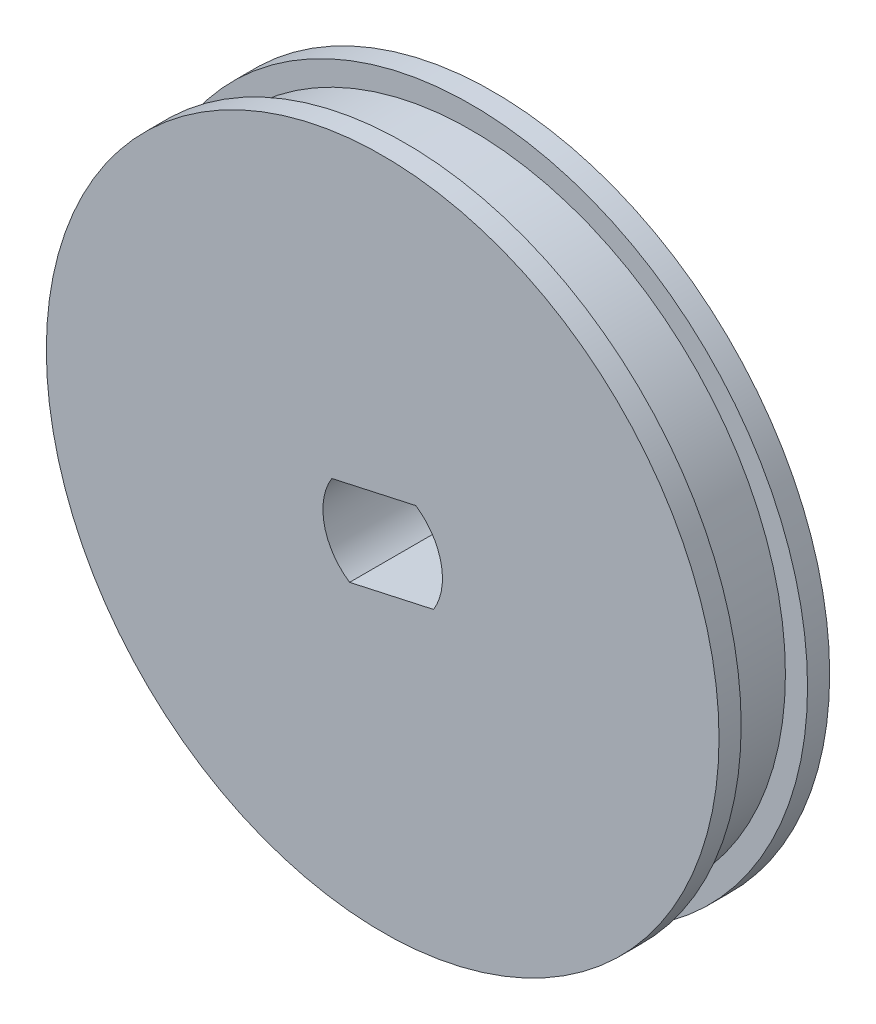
ISO-10303-21;
HEADER;
FILE_DESCRIPTION(('STEP AP214'),'2;1');
FILE_NAME('part.step','',(''),(''),'','','');
FILE_SCHEMA(('AUTOMOTIVE_DESIGN { 1 0 10303 214 1 1 1 1 }'));
ENDSEC;
DATA;
#1=APPLICATION_CONTEXT('core data for automotive mechanical design processes');
#2=APPLICATION_PROTOCOL_DEFINITION('international standard','automotive_design',2000,#1);
#3=PRODUCT_CONTEXT('',#1,'mechanical');
#4=PRODUCT('Part','Part','',(#3));
#5=PRODUCT_RELATED_PRODUCT_CATEGORY('part','',(#4));
#6=PRODUCT_DEFINITION_FORMATION('','',#4);
#7=PRODUCT_DEFINITION_CONTEXT('part definition',#1,'design');
#8=PRODUCT_DEFINITION('design','',#6,#7);
#9=PRODUCT_DEFINITION_SHAPE('','',#8);
#10=(LENGTH_UNIT() NAMED_UNIT(*) SI_UNIT(.MILLI.,.METRE.));
#11=(NAMED_UNIT(*) PLANE_ANGLE_UNIT() SI_UNIT($,.RADIAN.));
#12=(NAMED_UNIT(*) SI_UNIT($,.STERADIAN.) SOLID_ANGLE_UNIT());
#13=UNCERTAINTY_MEASURE_WITH_UNIT(LENGTH_MEASURE(1.E-05),#10,'distance_accuracy_value','');
#14=(GEOMETRIC_REPRESENTATION_CONTEXT(3) GLOBAL_UNCERTAINTY_ASSIGNED_CONTEXT((#13)) GLOBAL_UNIT_ASSIGNED_CONTEXT((#10,
#11,#12)) REPRESENTATION_CONTEXT('',''));
#15=CARTESIAN_POINT('',(0.,0.,0.));
#16=DIRECTION('',(0.,0.,1.));
#17=DIRECTION('',(1.,0.,0.));
#18=AXIS2_PLACEMENT_3D('',#15,#16,#17);
#19=CARTESIAN_POINT('',(22.4165324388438,-13.7076740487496,-1.5));
#20=DIRECTION('',(0.,0.,1.));
#21=DIRECTION('',(-1.,0.,0.));
#22=AXIS2_PLACEMENT_3D('',#19,#20,#21);
#23=CYLINDRICAL_SURFACE('',#22,14.2);
#24=CARTESIAN_POINT('',(22.4165324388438,-13.7076740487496,-1.5));
#25=DIRECTION('',(0.,0.,1.));
#26=DIRECTION('',(1.,0.,0.));
#27=AXIS2_PLACEMENT_3D('',#24,#25,#26);
#28=CIRCLE('',#27,14.2);
#29=CARTESIAN_POINT('',(36.6165324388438,-13.7076740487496,-1.5));
#30=VERTEX_POINT('',#29);
#31=EDGE_CURVE('E11',#30,#30,#28,.T.);
#32=ORIENTED_EDGE('',*,*,#31,.T.);
#33=EDGE_LOOP('',(#32));
#34=FACE_BOUND('',#33,.T.);
#35=CARTESIAN_POINT('',(22.4165324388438,-13.7076740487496,1.5));
#36=DIRECTION('',(0.,0.,1.));
#37=DIRECTION('',(1.,0.,0.));
#38=AXIS2_PLACEMENT_3D('',#35,#36,#37);
#39=CIRCLE('',#38,14.2);
#40=CARTESIAN_POINT('',(36.6165324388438,-13.7076740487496,1.5));
#41=VERTEX_POINT('',#40);
#42=EDGE_CURVE('E44',#41,#41,#39,.T.);
#43=ORIENTED_EDGE('',*,*,#42,.F.);
#44=EDGE_LOOP('',(#43));
#45=FACE_BOUND('',#44,.T.);
#46=ADVANCED_FACE('F41',(#34,#45),#23,.T.);
#47=CARTESIAN_POINT('',(22.4165324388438,-13.7076740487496,-2.5));
#48=DIRECTION('',(0.,0.,1.));
#49=DIRECTION('',(-1.,0.,0.));
#50=AXIS2_PLACEMENT_3D('',#47,#48,#49);
#51=CYLINDRICAL_SURFACE('',#50,15.2);
#52=CARTESIAN_POINT('',(22.4165324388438,-13.7076740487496,-2.5));
#53=DIRECTION('',(0.,0.,1.));
#54=DIRECTION('',(1.,0.,0.));
#55=AXIS2_PLACEMENT_3D('',#52,#53,#54);
#56=CIRCLE('',#55,15.2);
#57=CARTESIAN_POINT('',(37.6165324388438,-13.7076740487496,-2.5));
#58=VERTEX_POINT('',#57);
#59=EDGE_CURVE('E49',#58,#58,#56,.T.);
#60=ORIENTED_EDGE('',*,*,#59,.T.);
#61=EDGE_LOOP('',(#60));
#62=FACE_BOUND('',#61,.T.);
#63=CARTESIAN_POINT('',(22.4165324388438,-13.7076740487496,-1.5));
#64=DIRECTION('',(0.,0.,1.));
#65=DIRECTION('',(1.,0.,0.));
#66=AXIS2_PLACEMENT_3D('',#63,#64,#65);
#67=CIRCLE('',#66,15.2);
#68=CARTESIAN_POINT('',(37.6165324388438,-13.7076740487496,-1.5));
#69=VERTEX_POINT('',#68);
#70=EDGE_CURVE('E127',#69,#69,#67,.T.);
#71=ORIENTED_EDGE('',*,*,#70,.F.);
#72=EDGE_LOOP('',(#71));
#73=FACE_BOUND('',#72,.T.);
#74=ADVANCED_FACE('F138',(#62,#73),#51,.T.);
#75=CARTESIAN_POINT('',(22.4165324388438,-13.7076740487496,-2.5));
#76=DIRECTION('',(0.,0.,-1.));
#77=DIRECTION('',(1.,0.,0.));
#78=AXIS2_PLACEMENT_3D('',#75,#76,#77);
#79=PLANE('',#78);
#80=CARTESIAN_POINT('',(22.4165324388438,-13.7076740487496,-2.5));
#81=DIRECTION('',(0.,0.,1.));
#82=DIRECTION('',(1.,0.,0.));
#83=AXIS2_PLACEMENT_3D('',#80,#81,#82);
#84=CIRCLE('',#83,2.7);
#85=CARTESIAN_POINT('',(24.7170575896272,-15.1210331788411,-2.5));
#86=VERTEX_POINT('',#85);
#87=CARTESIAN_POINT('',(23.9106554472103,-11.4587639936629,-2.5));
#88=VERTEX_POINT('',#87);
#89=EDGE_CURVE('E110',#86,#88,#84,.T.);
#90=ORIENTED_EDGE('',*,*,#89,.T.);
#91=DIRECTION('',(-0.97660511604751,-0.215040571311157,0.));
#92=VECTOR('',#91,1.);
#93=CARTESIAN_POINT('',(23.9106554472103,-11.4587639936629,-2.5));
#94=LINE('',#93,#92);
#95=CARTESIAN_POINT('',(20.1160072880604,-12.294314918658,-2.5));
#96=VERTEX_POINT('',#95);
#97=EDGE_CURVE('E87',#88,#96,#94,.T.);
#98=ORIENTED_EDGE('',*,*,#97,.T.);
#99=CARTESIAN_POINT('',(22.4165324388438,-13.7076740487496,-2.5));
#100=DIRECTION('',(0.,0.,1.));
#101=DIRECTION('',(1.,0.,0.));
#102=AXIS2_PLACEMENT_3D('',#99,#100,#101);
#103=CIRCLE('',#102,2.70000000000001);
#104=CARTESIAN_POINT('',(20.9224094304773,-15.9565841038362,-2.5));
#105=VERTEX_POINT('',#104);
#106=EDGE_CURVE('E105',#96,#105,#103,.T.);
#107=ORIENTED_EDGE('',*,*,#106,.T.);
#108=DIRECTION('',(0.97660511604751,0.215040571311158,0.));
#109=VECTOR('',#108,1.);
#110=CARTESIAN_POINT('',(20.9224094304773,-15.9565841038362,-2.5));
#111=LINE('',#110,#109);
#112=EDGE_CURVE('E102',#105,#86,#111,.T.);
#113=ORIENTED_EDGE('',*,*,#112,.T.);
#114=EDGE_LOOP('',(#90,#98,#107,#113));
#115=FACE_BOUND('',#114,.T.);
#116=ORIENTED_EDGE('',*,*,#59,.F.);
#117=EDGE_LOOP('',(#116));
#118=FACE_BOUND('',#117,.T.);
#119=ADVANCED_FACE('F143',(#115,#118),#79,.T.);
#120=CARTESIAN_POINT('',(22.4165324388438,-13.7076740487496,-1.5));
#121=DIRECTION('',(0.,0.,-1.));
#122=DIRECTION('',(1.,0.,0.));
#123=AXIS2_PLACEMENT_3D('',#120,#121,#122);
#124=PLANE('',#123);
#125=ORIENTED_EDGE('',*,*,#31,.F.);
#126=EDGE_LOOP('',(#125));
#127=FACE_BOUND('',#126,.T.);
#128=ORIENTED_EDGE('',*,*,#70,.T.);
#129=EDGE_LOOP('',(#128));
#130=FACE_BOUND('',#129,.T.);
#131=ADVANCED_FACE('F147',(#127,#130),#124,.F.);
#132=CARTESIAN_POINT('',(22.4165324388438,-13.7076740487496,2.5));
#133=DIRECTION('',(0.,0.,-1.));
#134=DIRECTION('',(1.,0.,0.));
#135=AXIS2_PLACEMENT_3D('',#132,#133,#134);
#136=CYLINDRICAL_SURFACE('',#135,15.2);
#137=CARTESIAN_POINT('',(22.4165324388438,-13.7076740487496,2.5));
#138=DIRECTION('',(0.,0.,1.));
#139=DIRECTION('',(1.,0.,0.));
#140=AXIS2_PLACEMENT_3D('',#137,#138,#139);
#141=CIRCLE('',#140,15.2);
#142=CARTESIAN_POINT('',(37.6165324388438,-13.7076740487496,2.5));
#143=VERTEX_POINT('',#142);
#144=EDGE_CURVE('E120',#143,#143,#141,.T.);
#145=ORIENTED_EDGE('',*,*,#144,.F.);
#146=EDGE_LOOP('',(#145));
#147=FACE_BOUND('',#146,.T.);
#148=CARTESIAN_POINT('',(22.4165324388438,-13.7076740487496,1.5));
#149=DIRECTION('',(0.,0.,1.));
#150=DIRECTION('',(1.,0.,0.));
#151=AXIS2_PLACEMENT_3D('',#148,#149,#150);
#152=CIRCLE('',#151,15.2);
#153=CARTESIAN_POINT('',(37.6165324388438,-13.7076740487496,1.5));
#154=VERTEX_POINT('',#153);
#155=EDGE_CURVE('E116',#154,#154,#152,.T.);
#156=ORIENTED_EDGE('',*,*,#155,.T.);
#157=EDGE_LOOP('',(#156));
#158=FACE_BOUND('',#157,.T.);
#159=ADVANCED_FACE('F149',(#147,#158),#136,.T.);
#160=CARTESIAN_POINT('',(22.4165324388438,-13.7076740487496,2.5));
#161=DIRECTION('',(0.,0.,1.));
#162=DIRECTION('',(1.,0.,0.));
#163=AXIS2_PLACEMENT_3D('',#160,#161,#162);
#164=PLANE('',#163);
#165=CARTESIAN_POINT('',(22.4165324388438,-13.7076740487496,2.5));
#166=DIRECTION('',(0.,0.,1.));
#167=DIRECTION('',(1.,0.,0.));
#168=AXIS2_PLACEMENT_3D('',#165,#166,#167);
#169=CIRCLE('',#168,2.7);
#170=CARTESIAN_POINT('',(24.7170575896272,-15.1210331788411,2.5));
#171=VERTEX_POINT('',#170);
#172=CARTESIAN_POINT('',(23.9106554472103,-11.4587639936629,2.5));
#173=VERTEX_POINT('',#172);
#174=EDGE_CURVE('E96',#171,#173,#169,.T.);
#175=ORIENTED_EDGE('',*,*,#174,.F.);
#176=DIRECTION('',(0.97660511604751,0.215040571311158,0.));
#177=VECTOR('',#176,1.);
#178=CARTESIAN_POINT('',(20.9224094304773,-15.9565841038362,2.5));
#179=LINE('',#178,#177);
#180=CARTESIAN_POINT('',(20.9224094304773,-15.9565841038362,2.5));
#181=VERTEX_POINT('',#180);
#182=EDGE_CURVE('E89',#181,#171,#179,.T.);
#183=ORIENTED_EDGE('',*,*,#182,.F.);
#184=CARTESIAN_POINT('',(22.4165324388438,-13.7076740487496,2.5));
#185=DIRECTION('',(0.,0.,1.));
#186=DIRECTION('',(1.,0.,0.));
#187=AXIS2_PLACEMENT_3D('',#184,#185,#186);
#188=CIRCLE('',#187,2.70000000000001);
#189=CARTESIAN_POINT('',(20.1160072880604,-12.294314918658,2.5));
#190=VERTEX_POINT('',#189);
#191=EDGE_CURVE('E97',#190,#181,#188,.T.);
#192=ORIENTED_EDGE('',*,*,#191,.F.);
#193=DIRECTION('',(-0.97660511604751,-0.215040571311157,0.));
#194=VECTOR('',#193,1.);
#195=CARTESIAN_POINT('',(23.9106554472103,-11.4587639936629,2.5));
#196=LINE('',#195,#194);
#197=EDGE_CURVE('E84',#173,#190,#196,.T.);
#198=ORIENTED_EDGE('',*,*,#197,.F.);
#199=EDGE_LOOP('',(#175,#183,#192,#198));
#200=FACE_BOUND('',#199,.T.);
#201=ORIENTED_EDGE('',*,*,#144,.T.);
#202=EDGE_LOOP('',(#201));
#203=FACE_BOUND('',#202,.T.);
#204=ADVANCED_FACE('F93',(#200,#203),#164,.T.);
#205=CARTESIAN_POINT('',(22.4165324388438,-13.7076740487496,1.5));
#206=DIRECTION('',(0.,0.,1.));
#207=DIRECTION('',(1.,0.,0.));
#208=AXIS2_PLACEMENT_3D('',#205,#206,#207);
#209=PLANE('',#208);
#210=ORIENTED_EDGE('',*,*,#42,.T.);
#211=EDGE_LOOP('',(#210));
#212=FACE_BOUND('',#211,.T.);
#213=ORIENTED_EDGE('',*,*,#155,.F.);
#214=EDGE_LOOP('',(#213));
#215=FACE_BOUND('',#214,.T.);
#216=ADVANCED_FACE('F134',(#212,#215),#209,.F.);
#217=CARTESIAN_POINT('',(22.4165324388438,-13.7076740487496,2.5));
#218=DIRECTION('',(0.,0.,-1.));
#219=DIRECTION('',(1.,0.,0.));
#220=AXIS2_PLACEMENT_3D('',#217,#218,#219);
#221=CYLINDRICAL_SURFACE('',#220,2.7);
#222=ORIENTED_EDGE('',*,*,#89,.F.);
#223=DIRECTION('',(0.,0.,-1.));
#224=VECTOR('',#223,1.);
#225=CARTESIAN_POINT('',(24.7170575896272,-15.1210331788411,2.5));
#226=LINE('',#225,#224);
#227=EDGE_CURVE('E100',#171,#86,#226,.T.);
#228=ORIENTED_EDGE('',*,*,#227,.F.);
#229=ORIENTED_EDGE('',*,*,#174,.T.);
#230=DIRECTION('',(0.,0.,-1.));
#231=VECTOR('',#230,1.);
#232=CARTESIAN_POINT('',(23.9106554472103,-11.4587639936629,2.5));
#233=LINE('',#232,#231);
#234=EDGE_CURVE('E56',#173,#88,#233,.T.);
#235=ORIENTED_EDGE('',*,*,#234,.T.);
#236=EDGE_LOOP('',(#222,#228,#229,#235));
#237=FACE_BOUND('',#236,.T.);
#238=ADVANCED_FACE('F99',(#237),#221,.F.);
#239=CARTESIAN_POINT('',(20.9224094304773,-15.9565841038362,2.5));
#240=DIRECTION('',(0.215040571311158,-0.97660511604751,0.));
#241=DIRECTION('',(0.97660511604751,0.215040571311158,0.));
#242=AXIS2_PLACEMENT_3D('',#239,#240,#241);
#243=PLANE('',#242);
#244=ORIENTED_EDGE('',*,*,#112,.F.);
#245=DIRECTION('',(0.,0.,-1.));
#246=VECTOR('',#245,1.);
#247=CARTESIAN_POINT('',(20.9224094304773,-15.9565841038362,2.5));
#248=LINE('',#247,#246);
#249=EDGE_CURVE('E117',#181,#105,#248,.T.);
#250=ORIENTED_EDGE('',*,*,#249,.F.);
#251=ORIENTED_EDGE('',*,*,#182,.T.);
#252=ORIENTED_EDGE('',*,*,#227,.T.);
#253=EDGE_LOOP('',(#244,#250,#251,#252));
#254=FACE_BOUND('',#253,.T.);
#255=ADVANCED_FACE('F166',(#254),#243,.F.);
#256=CARTESIAN_POINT('',(22.4165324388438,-13.7076740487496,2.5));
#257=DIRECTION('',(0.,0.,-1.));
#258=DIRECTION('',(1.,0.,0.));
#259=AXIS2_PLACEMENT_3D('',#256,#257,#258);
#260=CYLINDRICAL_SURFACE('',#259,2.70000000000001);
#261=ORIENTED_EDGE('',*,*,#106,.F.);
#262=DIRECTION('',(0.,0.,-1.));
#263=VECTOR('',#262,1.);
#264=CARTESIAN_POINT('',(20.1160072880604,-12.294314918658,2.5));
#265=LINE('',#264,#263);
#266=EDGE_CURVE('E64',#190,#96,#265,.T.);
#267=ORIENTED_EDGE('',*,*,#266,.F.);
#268=ORIENTED_EDGE('',*,*,#191,.T.);
#269=ORIENTED_EDGE('',*,*,#249,.T.);
#270=EDGE_LOOP('',(#261,#267,#268,#269));
#271=FACE_BOUND('',#270,.T.);
#272=ADVANCED_FACE('F169',(#271),#260,.F.);
#273=CARTESIAN_POINT('',(23.9106554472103,-11.4587639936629,2.5));
#274=DIRECTION('',(-0.215040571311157,0.976605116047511,0.));
#275=DIRECTION('',(-0.97660511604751,-0.215040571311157,0.));
#276=AXIS2_PLACEMENT_3D('',#273,#274,#275);
#277=PLANE('',#276);
#278=ORIENTED_EDGE('',*,*,#97,.F.);
#279=ORIENTED_EDGE('',*,*,#234,.F.);
#280=ORIENTED_EDGE('',*,*,#197,.T.);
#281=ORIENTED_EDGE('',*,*,#266,.T.);
#282=EDGE_LOOP('',(#278,#279,#280,#281));
#283=FACE_BOUND('',#282,.T.);
#284=ADVANCED_FACE('F83',(#283),#277,.F.);
#285=CLOSED_SHELL('',(#46,#74,#119,#131,#159,#204,#216,#238,#255,#272,#284));
#286=MANIFOLD_SOLID_BREP('B2',#285);
#287=ADVANCED_BREP_SHAPE_REPRESENTATION('',(#18,#286),#14);
#288=SHAPE_DEFINITION_REPRESENTATION(#9,#287);
ENDSEC;
END-ISO-10303-21;
